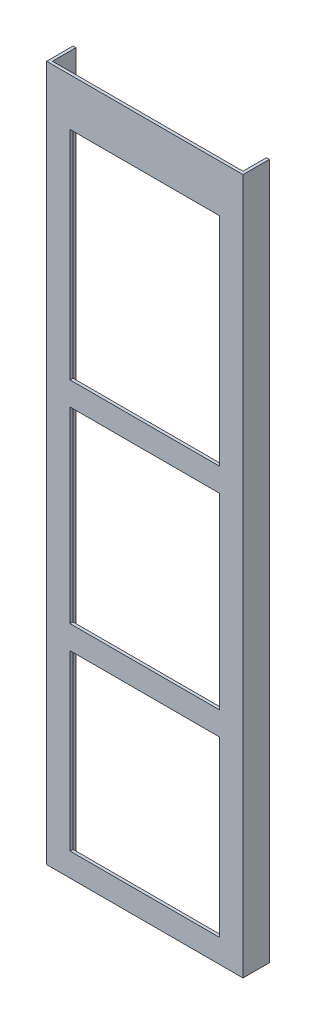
ISO-10303-21;
HEADER;
FILE_DESCRIPTION(('STEP AP214'),'2;1');
FILE_NAME('part.step','',(''),(''),'','','');
FILE_SCHEMA(('AUTOMOTIVE_DESIGN { 1 0 10303 214 1 1 1 1 }'));
ENDSEC;
DATA;
#1=APPLICATION_CONTEXT('core data for automotive mechanical design processes');
#2=APPLICATION_PROTOCOL_DEFINITION('international standard','automotive_design',2000,#1);
#3=PRODUCT_CONTEXT('',#1,'mechanical');
#4=PRODUCT('Part','Part','',(#3));
#5=PRODUCT_RELATED_PRODUCT_CATEGORY('part','',(#4));
#6=PRODUCT_DEFINITION_FORMATION('','',#4);
#7=PRODUCT_DEFINITION_CONTEXT('part definition',#1,'design');
#8=PRODUCT_DEFINITION('design','',#6,#7);
#9=PRODUCT_DEFINITION_SHAPE('','',#8);
#10=(LENGTH_UNIT() NAMED_UNIT(*) SI_UNIT(.MILLI.,.METRE.));
#11=(NAMED_UNIT(*) PLANE_ANGLE_UNIT() SI_UNIT($,.RADIAN.));
#12=(NAMED_UNIT(*) SI_UNIT($,.STERADIAN.) SOLID_ANGLE_UNIT());
#13=UNCERTAINTY_MEASURE_WITH_UNIT(LENGTH_MEASURE(1.E-05),#10,'distance_accuracy_value','');
#14=(GEOMETRIC_REPRESENTATION_CONTEXT(3) GLOBAL_UNCERTAINTY_ASSIGNED_CONTEXT((#13)) GLOBAL_UNIT_ASSIGNED_CONTEXT((#10,
#11,#12)) REPRESENTATION_CONTEXT('',''));
#15=CARTESIAN_POINT('',(0.,0.,0.));
#16=DIRECTION('',(0.,0.,1.));
#17=DIRECTION('',(1.,0.,0.));
#18=AXIS2_PLACEMENT_3D('',#15,#16,#17);
#19=CARTESIAN_POINT('',(-40.475,12.7,49.0475));
#20=DIRECTION('',(-1.,0.,0.));
#21=DIRECTION('',(0.,0.,1.));
#22=AXIS2_PLACEMENT_3D('',#19,#20,#21);
#23=PLANE('',#22);
#24=DIRECTION('',(0.,0.,1.));
#25=VECTOR('',#24,1.);
#26=CARTESIAN_POINT('',(-40.475,119.38,50.));
#27=LINE('',#26,#25);
#28=CARTESIAN_POINT('',(-40.475,119.38,50.));
#29=VERTEX_POINT('',#28);
#30=CARTESIAN_POINT('',(-40.475,119.38,51.5875));
#31=VERTEX_POINT('',#30);
#32=EDGE_CURVE('E59',#29,#31,#27,.T.);
#33=ORIENTED_EDGE('',*,*,#32,.F.);
#34=DIRECTION('',(0.,1.,0.));
#35=VECTOR('',#34,1.);
#36=CARTESIAN_POINT('',(-40.475,376.8,50.));
#37=LINE('',#36,#35);
#38=CARTESIAN_POINT('',(-40.475,220.98,50.));
#39=VERTEX_POINT('',#38);
#40=EDGE_CURVE('E267',#29,#39,#37,.T.);
#41=ORIENTED_EDGE('',*,*,#40,.T.);
#42=DIRECTION('',(0.,0.,1.));
#43=VECTOR('',#42,1.);
#44=CARTESIAN_POINT('',(-40.475,220.98,50.));
#45=LINE('',#44,#43);
#46=CARTESIAN_POINT('',(-40.475,220.98,51.5875));
#47=VERTEX_POINT('',#46);
#48=EDGE_CURVE('E236',#39,#47,#45,.T.);
#49=ORIENTED_EDGE('',*,*,#48,.T.);
#50=DIRECTION('',(0.,-1.,0.));
#51=VECTOR('',#50,1.);
#52=CARTESIAN_POINT('',(-40.475,12.7,51.5875));
#53=LINE('',#52,#51);
#54=EDGE_CURVE('E55',#47,#31,#53,.T.);
#55=ORIENTED_EDGE('',*,*,#54,.T.);
#56=EDGE_LOOP('',(#33,#41,#49,#55));
#57=FACE_BOUND('',#56,.T.);
#58=ADVANCED_FACE('F39',(#57),#23,.F.);
#59=CARTESIAN_POINT('',(40.475,12.7,49.0475));
#60=DIRECTION('',(1.,0.,0.));
#61=DIRECTION('',(0.,0.,-1.));
#62=AXIS2_PLACEMENT_3D('',#59,#60,#61);
#63=PLANE('',#62);
#64=DIRECTION('',(0.,0.,1.));
#65=VECTOR('',#64,1.);
#66=CARTESIAN_POINT('',(40.475,119.38,50.));
#67=LINE('',#66,#65);
#68=CARTESIAN_POINT('',(40.475,119.38,50.));
#69=VERTEX_POINT('',#68);
#70=CARTESIAN_POINT('',(40.475,119.38,51.5875));
#71=VERTEX_POINT('',#70);
#72=EDGE_CURVE('E211',#69,#71,#67,.T.);
#73=ORIENTED_EDGE('',*,*,#72,.T.);
#74=DIRECTION('',(0.,1.,0.));
#75=VECTOR('',#74,1.);
#76=CARTESIAN_POINT('',(40.475,12.7,51.5875));
#77=LINE('',#76,#75);
#78=CARTESIAN_POINT('',(40.475,220.98,51.5875));
#79=VERTEX_POINT('',#78);
#80=EDGE_CURVE('E254',#71,#79,#77,.T.);
#81=ORIENTED_EDGE('',*,*,#80,.T.);
#82=DIRECTION('',(0.,0.,1.));
#83=VECTOR('',#82,1.);
#84=CARTESIAN_POINT('',(40.475,220.98,50.));
#85=LINE('',#84,#83);
#86=CARTESIAN_POINT('',(40.475,220.98,50.));
#87=VERTEX_POINT('',#86);
#88=EDGE_CURVE('E233',#87,#79,#85,.T.);
#89=ORIENTED_EDGE('',*,*,#88,.F.);
#90=DIRECTION('',(0.,-1.,0.));
#91=VECTOR('',#90,1.);
#92=CARTESIAN_POINT('',(40.475,376.8,50.));
#93=LINE('',#92,#91);
#94=EDGE_CURVE('E264',#87,#69,#93,.T.);
#95=ORIENTED_EDGE('',*,*,#94,.T.);
#96=EDGE_LOOP('',(#73,#81,#89,#95));
#97=FACE_BOUND('',#96,.T.);
#98=ADVANCED_FACE('F379',(#97),#63,.F.);
#99=DIRECTION('',(0.,0.,1.));
#100=VECTOR('',#99,1.);
#101=CARTESIAN_POINT('',(-40.475,233.68,50.));
#102=LINE('',#101,#100);
#103=CARTESIAN_POINT('',(-40.475,233.68,50.));
#104=VERTEX_POINT('',#103);
#105=CARTESIAN_POINT('',(-40.475,233.68,51.5875));
#106=VERTEX_POINT('',#105);
#107=EDGE_CURVE('E224',#104,#106,#102,.T.);
#108=ORIENTED_EDGE('',*,*,#107,.F.);
#109=CARTESIAN_POINT('',(-40.475,351.155,50.));
#110=VERTEX_POINT('',#109);
#111=EDGE_CURVE('E263',#104,#110,#37,.T.);
#112=ORIENTED_EDGE('',*,*,#111,.T.);
#113=DIRECTION('',(0.,0.,1.));
#114=VECTOR('',#113,1.);
#115=CARTESIAN_POINT('',(-40.475,351.155,50.));
#116=LINE('',#115,#114);
#117=CARTESIAN_POINT('',(-40.475,351.155,51.5875));
#118=VERTEX_POINT('',#117);
#119=EDGE_CURVE('E243',#110,#118,#116,.T.);
#120=ORIENTED_EDGE('',*,*,#119,.T.);
#121=EDGE_CURVE('E188',#118,#106,#53,.T.);
#122=ORIENTED_EDGE('',*,*,#121,.T.);
#123=EDGE_LOOP('',(#108,#112,#120,#122));
#124=FACE_BOUND('',#123,.T.);
#125=ADVANCED_FACE('F381',(#124),#23,.F.);
#126=DIRECTION('',(0.,0.,1.));
#127=VECTOR('',#126,1.);
#128=CARTESIAN_POINT('',(40.475,233.68,50.));
#129=LINE('',#128,#127);
#130=CARTESIAN_POINT('',(40.475,233.68,50.));
#131=VERTEX_POINT('',#130);
#132=CARTESIAN_POINT('',(40.475,233.68,51.5875));
#133=VERTEX_POINT('',#132);
#134=EDGE_CURVE('E229',#131,#133,#129,.T.);
#135=ORIENTED_EDGE('',*,*,#134,.T.);
#136=CARTESIAN_POINT('',(40.475,351.155,51.5875));
#137=VERTEX_POINT('',#136);
#138=EDGE_CURVE('E250',#133,#137,#77,.T.);
#139=ORIENTED_EDGE('',*,*,#138,.T.);
#140=DIRECTION('',(0.,0.,1.));
#141=VECTOR('',#140,1.);
#142=CARTESIAN_POINT('',(40.475,351.155,50.));
#143=LINE('',#142,#141);
#144=CARTESIAN_POINT('',(40.475,351.155,50.));
#145=VERTEX_POINT('',#144);
#146=EDGE_CURVE('E186',#145,#137,#143,.T.);
#147=ORIENTED_EDGE('',*,*,#146,.F.);
#148=EDGE_CURVE('E261',#145,#131,#93,.T.);
#149=ORIENTED_EDGE('',*,*,#148,.T.);
#150=EDGE_LOOP('',(#135,#139,#147,#149));
#151=FACE_BOUND('',#150,.T.);
#152=ADVANCED_FACE('F388',(#151),#63,.F.);
#153=CARTESIAN_POINT('',(50.,376.8,50.));
#154=DIRECTION('',(0.,0.,-1.));
#155=DIRECTION('',(-1.,0.,0.));
#156=AXIS2_PLACEMENT_3D('',#153,#154,#155);
#157=PLANE('',#156);
#158=ORIENTED_EDGE('',*,*,#40,.F.);
#159=DIRECTION('',(1.,0.,0.));
#160=VECTOR('',#159,1.);
#161=CARTESIAN_POINT('',(0.,119.38,50.));
#162=LINE('',#161,#160);
#163=EDGE_CURVE('E201',#29,#69,#162,.T.);
#164=ORIENTED_EDGE('',*,*,#163,.T.);
#165=ORIENTED_EDGE('',*,*,#94,.F.);
#166=DIRECTION('',(1.,0.,0.));
#167=VECTOR('',#166,1.);
#168=CARTESIAN_POINT('',(0.,220.98,50.));
#169=LINE('',#168,#167);
#170=EDGE_CURVE('E220',#39,#87,#169,.T.);
#171=ORIENTED_EDGE('',*,*,#170,.F.);
#172=EDGE_LOOP('',(#158,#164,#165,#171));
#173=FACE_BOUND('',#172,.T.);
#174=ORIENTED_EDGE('',*,*,#111,.F.);
#175=DIRECTION('',(1.,0.,0.));
#176=VECTOR('',#175,1.);
#177=CARTESIAN_POINT('',(0.,233.68,50.));
#178=LINE('',#177,#176);
#179=EDGE_CURVE('E217',#104,#131,#178,.T.);
#180=ORIENTED_EDGE('',*,*,#179,.T.);
#181=ORIENTED_EDGE('',*,*,#148,.F.);
#182=DIRECTION('',(1.,0.,0.));
#183=VECTOR('',#182,1.);
#184=CARTESIAN_POINT('',(0.,351.155,50.));
#185=LINE('',#184,#183);
#186=EDGE_CURVE('E240',#110,#145,#185,.T.);
#187=ORIENTED_EDGE('',*,*,#186,.F.);
#188=EDGE_LOOP('',(#174,#180,#181,#187));
#189=FACE_BOUND('',#188,.T.);
#190=CARTESIAN_POINT('',(-40.475,12.7,50.));
#191=VERTEX_POINT('',#190);
#192=CARTESIAN_POINT('',(-40.475,106.68,50.));
#193=VERTEX_POINT('',#192);
#194=EDGE_CURVE('E193',#191,#193,#37,.T.);
#195=ORIENTED_EDGE('',*,*,#194,.F.);
#196=DIRECTION('',(-1.,0.,0.));
#197=VECTOR('',#196,1.);
#198=CARTESIAN_POINT('',(50.,12.7,50.));
#199=LINE('',#198,#197);
#200=CARTESIAN_POINT('',(40.475,12.7,50.));
#201=VERTEX_POINT('',#200);
#202=EDGE_CURVE('E257',#201,#191,#199,.T.);
#203=ORIENTED_EDGE('',*,*,#202,.F.);
#204=CARTESIAN_POINT('',(40.475,106.68,50.));
#205=VERTEX_POINT('',#204);
#206=EDGE_CURVE('E260',#205,#201,#93,.T.);
#207=ORIENTED_EDGE('',*,*,#206,.F.);
#208=DIRECTION('',(1.,0.,0.));
#209=VECTOR('',#208,1.);
#210=CARTESIAN_POINT('',(0.,106.68,50.));
#211=LINE('',#210,#209);
#212=EDGE_CURVE('E205',#193,#205,#211,.T.);
#213=ORIENTED_EDGE('',*,*,#212,.F.);
#214=EDGE_LOOP('',(#195,#203,#207,#213));
#215=FACE_BOUND('',#214,.T.);
#216=DIRECTION('',(1.,0.,0.));
#217=VECTOR('',#216,1.);
#218=CARTESIAN_POINT('',(-51.6,0.,50.));
#219=LINE('',#218,#217);
#220=CARTESIAN_POINT('',(-51.5875000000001,0.,50.));
#221=VERTEX_POINT('',#220);
#222=CARTESIAN_POINT('',(51.5875,0.,50.));
#223=VERTEX_POINT('',#222);
#224=EDGE_CURVE('E315',#221,#223,#219,.T.);
#225=ORIENTED_EDGE('',*,*,#224,.F.);
#226=DIRECTION('',(0.,-1.,0.));
#227=VECTOR('',#226,1.);
#228=CARTESIAN_POINT('',(-51.5875,376.8,50.));
#229=LINE('',#228,#227);
#230=CARTESIAN_POINT('',(-51.5875,376.8,50.));
#231=VERTEX_POINT('',#230);
#232=EDGE_CURVE('E266',#231,#221,#229,.T.);
#233=ORIENTED_EDGE('',*,*,#232,.F.);
#234=DIRECTION('',(1.,0.,0.));
#235=VECTOR('',#234,1.);
#236=CARTESIAN_POINT('',(50.,376.8,50.));
#237=LINE('',#236,#235);
#238=CARTESIAN_POINT('',(51.5875,376.8,50.));
#239=VERTEX_POINT('',#238);
#240=EDGE_CURVE('E11',#231,#239,#237,.T.);
#241=ORIENTED_EDGE('',*,*,#240,.T.);
#242=DIRECTION('',(0.,1.,0.));
#243=VECTOR('',#242,1.);
#244=CARTESIAN_POINT('',(51.5875,376.8,50.));
#245=LINE('',#244,#243);
#246=EDGE_CURVE('E286',#223,#239,#245,.T.);
#247=ORIENTED_EDGE('',*,*,#246,.F.);
#248=EDGE_LOOP('',(#225,#233,#241,#247));
#249=FACE_BOUND('',#248,.T.);
#250=ADVANCED_FACE('F356',(#173,#189,#215,#249),#157,.T.);
#251=CARTESIAN_POINT('',(0.,376.8,0.));
#252=DIRECTION('',(0.,-1.,0.));
#253=DIRECTION('',(0.,0.,-1.));
#254=AXIS2_PLACEMENT_3D('',#251,#252,#253);
#255=PLANE('',#254);
#256=DIRECTION('',(1.,0.,0.));
#257=VECTOR('',#256,1.);
#258=CARTESIAN_POINT('',(51.5875,376.8,51.5875));
#259=LINE('',#258,#257);
#260=CARTESIAN_POINT('',(-53.175,376.8,51.5875));
#261=VERTEX_POINT('',#260);
#262=CARTESIAN_POINT('',(53.175,376.8,51.5875));
#263=VERTEX_POINT('',#262);
#264=EDGE_CURVE('E316',#261,#263,#259,.T.);
#265=ORIENTED_EDGE('',*,*,#264,.T.);
#266=DIRECTION('',(0.,0.,1.));
#267=VECTOR('',#266,1.);
#268=CARTESIAN_POINT('',(53.175,376.8,51.5875));
#269=LINE('',#268,#267);
#270=CARTESIAN_POINT('',(53.175,376.8,37.3));
#271=VERTEX_POINT('',#270);
#272=EDGE_CURVE('E321',#271,#263,#269,.T.);
#273=ORIENTED_EDGE('',*,*,#272,.F.);
#274=DIRECTION('',(1.,0.,0.));
#275=VECTOR('',#274,1.);
#276=CARTESIAN_POINT('',(53.175,376.8,37.3));
#277=LINE('',#276,#275);
#278=CARTESIAN_POINT('',(51.5875,376.8,37.3));
#279=VERTEX_POINT('',#278);
#280=EDGE_CURVE('E294',#279,#271,#277,.T.);
#281=ORIENTED_EDGE('',*,*,#280,.F.);
#282=DIRECTION('',(0.,0.,1.));
#283=VECTOR('',#282,1.);
#284=CARTESIAN_POINT('',(51.5875,376.8,37.3));
#285=LINE('',#284,#283);
#286=EDGE_CURVE('E297',#279,#239,#285,.T.);
#287=ORIENTED_EDGE('',*,*,#286,.T.);
#288=ORIENTED_EDGE('',*,*,#240,.F.);
#289=DIRECTION('',(0.,0.,1.));
#290=VECTOR('',#289,1.);
#291=CARTESIAN_POINT('',(-51.5875,376.8,37.3));
#292=LINE('',#291,#290);
#293=CARTESIAN_POINT('',(-51.5875,376.8,37.3));
#294=VERTEX_POINT('',#293);
#295=EDGE_CURVE('E283',#294,#231,#292,.T.);
#296=ORIENTED_EDGE('',*,*,#295,.F.);
#297=DIRECTION('',(1.,0.,0.));
#298=VECTOR('',#297,1.);
#299=CARTESIAN_POINT('',(-53.175,376.8,37.3));
#300=LINE('',#299,#298);
#301=CARTESIAN_POINT('',(-53.175,376.8,37.3));
#302=VERTEX_POINT('',#301);
#303=EDGE_CURVE('E271',#302,#294,#300,.T.);
#304=ORIENTED_EDGE('',*,*,#303,.F.);
#305=DIRECTION('',(0.,0.,1.));
#306=VECTOR('',#305,1.);
#307=CARTESIAN_POINT('',(-53.175,376.8,51.5875));
#308=LINE('',#307,#306);
#309=EDGE_CURVE('E335',#302,#261,#308,.T.);
#310=ORIENTED_EDGE('',*,*,#309,.T.);
#311=EDGE_LOOP('',(#265,#273,#281,#287,#288,#296,#304,#310));
#312=FACE_BOUND('',#311,.T.);
#313=ADVANCED_FACE('F41',(#312),#255,.F.);
#314=CARTESIAN_POINT('',(0.,0.,0.));
#315=DIRECTION('',(0.,-1.,0.));
#316=DIRECTION('',(0.,0.,-1.));
#317=AXIS2_PLACEMENT_3D('',#314,#315,#316);
#318=PLANE('',#317);
#319=DIRECTION('',(0.,0.,-1.));
#320=VECTOR('',#319,1.);
#321=CARTESIAN_POINT('',(-53.175,0.,51.5875));
#322=LINE('',#321,#320);
#323=CARTESIAN_POINT('',(-53.175,0.,51.5875));
#324=VERTEX_POINT('',#323);
#325=CARTESIAN_POINT('',(-53.175,0.,37.3));
#326=VERTEX_POINT('',#325);
#327=EDGE_CURVE('E334',#324,#326,#322,.T.);
#328=ORIENTED_EDGE('',*,*,#327,.T.);
#329=DIRECTION('',(-1.,0.,0.));
#330=VECTOR('',#329,1.);
#331=CARTESIAN_POINT('',(-53.175,0.,37.3));
#332=LINE('',#331,#330);
#333=CARTESIAN_POINT('',(-51.5875000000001,0.,37.3));
#334=VERTEX_POINT('',#333);
#335=EDGE_CURVE('E275',#334,#326,#332,.T.);
#336=ORIENTED_EDGE('',*,*,#335,.F.);
#337=DIRECTION('',(0.,0.,1.));
#338=VECTOR('',#337,1.);
#339=CARTESIAN_POINT('',(-51.5875000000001,0.,37.3));
#340=LINE('',#339,#338);
#341=EDGE_CURVE('E278',#334,#221,#340,.T.);
#342=ORIENTED_EDGE('',*,*,#341,.T.);
#343=ORIENTED_EDGE('',*,*,#224,.T.);
#344=DIRECTION('',(0.,0.,1.));
#345=VECTOR('',#344,1.);
#346=CARTESIAN_POINT('',(51.5875,0.,37.3));
#347=LINE('',#346,#345);
#348=CARTESIAN_POINT('',(51.5875,0.,37.3));
#349=VERTEX_POINT('',#348);
#350=EDGE_CURVE('E309',#349,#223,#347,.T.);
#351=ORIENTED_EDGE('',*,*,#350,.F.);
#352=DIRECTION('',(-1.,0.,0.));
#353=VECTOR('',#352,1.);
#354=CARTESIAN_POINT('',(53.175,0.,37.3));
#355=LINE('',#354,#353);
#356=CARTESIAN_POINT('',(53.175,0.,37.3));
#357=VERTEX_POINT('',#356);
#358=EDGE_CURVE('E290',#357,#349,#355,.T.);
#359=ORIENTED_EDGE('',*,*,#358,.F.);
#360=DIRECTION('',(0.,0.,-1.));
#361=VECTOR('',#360,1.);
#362=CARTESIAN_POINT('',(53.175,0.,51.5875));
#363=LINE('',#362,#361);
#364=CARTESIAN_POINT('',(53.175,0.,51.5875));
#365=VERTEX_POINT('',#364);
#366=EDGE_CURVE('E326',#365,#357,#363,.T.);
#367=ORIENTED_EDGE('',*,*,#366,.F.);
#368=DIRECTION('',(1.,0.,0.));
#369=VECTOR('',#368,1.);
#370=CARTESIAN_POINT('',(51.5875,0.,51.5875));
#371=LINE('',#370,#369);
#372=EDGE_CURVE('E48',#324,#365,#371,.T.);
#373=ORIENTED_EDGE('',*,*,#372,.F.);
#374=EDGE_LOOP('',(#328,#336,#342,#343,#351,#359,#367,#373));
#375=FACE_BOUND('',#374,.T.);
#376=ADVANCED_FACE('F346',(#375),#318,.T.);
#377=CARTESIAN_POINT('',(51.5875,376.8,51.5875));
#378=DIRECTION('',(0.,0.,-1.));
#379=DIRECTION('',(-1.,0.,0.));
#380=AXIS2_PLACEMENT_3D('',#377,#378,#379);
#381=PLANE('',#380);
#382=DIRECTION('',(1.,0.,0.));
#383=VECTOR('',#382,1.);
#384=CARTESIAN_POINT('',(0.,119.38,51.5875));
#385=LINE('',#384,#383);
#386=EDGE_CURVE('E202',#31,#71,#385,.T.);
#387=ORIENTED_EDGE('',*,*,#386,.F.);
#388=ORIENTED_EDGE('',*,*,#54,.F.);
#389=DIRECTION('',(1.,0.,0.));
#390=VECTOR('',#389,1.);
#391=CARTESIAN_POINT('',(0.,220.98,51.5875));
#392=LINE('',#391,#390);
#393=EDGE_CURVE('E221',#47,#79,#392,.T.);
#394=ORIENTED_EDGE('',*,*,#393,.T.);
#395=ORIENTED_EDGE('',*,*,#80,.F.);
#396=EDGE_LOOP('',(#387,#388,#394,#395));
#397=FACE_BOUND('',#396,.T.);
#398=DIRECTION('',(1.,0.,0.));
#399=VECTOR('',#398,1.);
#400=CARTESIAN_POINT('',(0.,233.68,51.5875));
#401=LINE('',#400,#399);
#402=EDGE_CURVE('E214',#106,#133,#401,.T.);
#403=ORIENTED_EDGE('',*,*,#402,.F.);
#404=ORIENTED_EDGE('',*,*,#121,.F.);
#405=DIRECTION('',(1.,0.,0.));
#406=VECTOR('',#405,1.);
#407=CARTESIAN_POINT('',(0.,351.155,51.5875));
#408=LINE('',#407,#406);
#409=EDGE_CURVE('E232',#118,#137,#408,.T.);
#410=ORIENTED_EDGE('',*,*,#409,.T.);
#411=ORIENTED_EDGE('',*,*,#138,.F.);
#412=EDGE_LOOP('',(#403,#404,#410,#411));
#413=FACE_BOUND('',#412,.T.);
#414=CARTESIAN_POINT('',(-40.475,106.68,51.5875));
#415=VERTEX_POINT('',#414);
#416=CARTESIAN_POINT('',(-40.475,12.7,51.5875));
#417=VERTEX_POINT('',#416);
#418=EDGE_CURVE('E174',#415,#417,#53,.T.);
#419=ORIENTED_EDGE('',*,*,#418,.F.);
#420=DIRECTION('',(1.,0.,0.));
#421=VECTOR('',#420,1.);
#422=CARTESIAN_POINT('',(0.,106.68,51.5875));
#423=LINE('',#422,#421);
#424=CARTESIAN_POINT('',(40.475,106.68,51.5875));
#425=VERTEX_POINT('',#424);
#426=EDGE_CURVE('E180',#415,#425,#423,.T.);
#427=ORIENTED_EDGE('',*,*,#426,.T.);
#428=CARTESIAN_POINT('',(40.475,12.7,51.5875));
#429=VERTEX_POINT('',#428);
#430=EDGE_CURVE('E251',#429,#425,#77,.T.);
#431=ORIENTED_EDGE('',*,*,#430,.F.);
#432=DIRECTION('',(1.,0.,0.));
#433=VECTOR('',#432,1.);
#434=CARTESIAN_POINT('',(40.475,12.7,51.5875));
#435=LINE('',#434,#433);
#436=EDGE_CURVE('E182',#417,#429,#435,.T.);
#437=ORIENTED_EDGE('',*,*,#436,.F.);
#438=EDGE_LOOP('',(#419,#427,#431,#437));
#439=FACE_BOUND('',#438,.T.);
#440=ORIENTED_EDGE('',*,*,#372,.T.);
#441=DIRECTION('',(0.,-1.,0.));
#442=VECTOR('',#441,1.);
#443=CARTESIAN_POINT('',(53.175,376.8,51.5875));
#444=LINE('',#443,#442);
#445=EDGE_CURVE('E331',#263,#365,#444,.T.);
#446=ORIENTED_EDGE('',*,*,#445,.F.);
#447=ORIENTED_EDGE('',*,*,#264,.F.);
#448=DIRECTION('',(0.,-1.,0.));
#449=VECTOR('',#448,1.);
#450=CARTESIAN_POINT('',(-53.175,376.8,51.5875));
#451=LINE('',#450,#449);
#452=EDGE_CURVE('E300',#261,#324,#451,.T.);
#453=ORIENTED_EDGE('',*,*,#452,.T.);
#454=EDGE_LOOP('',(#440,#446,#447,#453));
#455=FACE_BOUND('',#454,.T.);
#456=ADVANCED_FACE('F176',(#397,#413,#439,#455),#381,.F.);
#457=CARTESIAN_POINT('',(53.175,0.,0.));
#458=DIRECTION('',(1.,0.,0.));
#459=DIRECTION('',(0.,0.,-1.));
#460=AXIS2_PLACEMENT_3D('',#457,#458,#459);
#461=PLANE('',#460);
#462=ORIENTED_EDGE('',*,*,#445,.T.);
#463=ORIENTED_EDGE('',*,*,#366,.T.);
#464=DIRECTION('',(0.,-1.,0.));
#465=VECTOR('',#464,1.);
#466=CARTESIAN_POINT('',(53.175,376.8,37.3));
#467=LINE('',#466,#465);
#468=EDGE_CURVE('E287',#271,#357,#467,.T.);
#469=ORIENTED_EDGE('',*,*,#468,.F.);
#470=ORIENTED_EDGE('',*,*,#272,.T.);
#471=EDGE_LOOP('',(#462,#463,#469,#470));
#472=FACE_BOUND('',#471,.T.);
#473=ADVANCED_FACE('F367',(#472),#461,.T.);
#474=CARTESIAN_POINT('',(-53.175,0.,0.));
#475=DIRECTION('',(-1.,0.,0.));
#476=DIRECTION('',(0.,0.,-1.));
#477=AXIS2_PLACEMENT_3D('',#474,#475,#476);
#478=PLANE('',#477);
#479=ORIENTED_EDGE('',*,*,#452,.F.);
#480=ORIENTED_EDGE('',*,*,#309,.F.);
#481=DIRECTION('',(0.,1.,0.));
#482=VECTOR('',#481,1.);
#483=CARTESIAN_POINT('',(-53.175,376.8,37.3));
#484=LINE('',#483,#482);
#485=EDGE_CURVE('E268',#326,#302,#484,.T.);
#486=ORIENTED_EDGE('',*,*,#485,.F.);
#487=ORIENTED_EDGE('',*,*,#327,.F.);
#488=EDGE_LOOP('',(#479,#480,#486,#487));
#489=FACE_BOUND('',#488,.T.);
#490=ADVANCED_FACE('F344',(#489),#478,.T.);
#491=CARTESIAN_POINT('',(51.5875,376.8,37.3));
#492=DIRECTION('',(1.,0.,0.));
#493=DIRECTION('',(0.,1.,0.));
#494=AXIS2_PLACEMENT_3D('',#491,#492,#493);
#495=PLANE('',#494);
#496=ORIENTED_EDGE('',*,*,#246,.T.);
#497=ORIENTED_EDGE('',*,*,#286,.F.);
#498=DIRECTION('',(0.,1.,0.));
#499=VECTOR('',#498,1.);
#500=CARTESIAN_POINT('',(51.5875,376.8,37.3));
#501=LINE('',#500,#499);
#502=EDGE_CURVE('E292',#349,#279,#501,.T.);
#503=ORIENTED_EDGE('',*,*,#502,.F.);
#504=ORIENTED_EDGE('',*,*,#350,.T.);
#505=EDGE_LOOP('',(#496,#497,#503,#504));
#506=FACE_BOUND('',#505,.T.);
#507=ADVANCED_FACE('F361',(#506),#495,.F.);
#508=CARTESIAN_POINT('',(0.,0.,37.3));
#509=DIRECTION('',(0.,0.,-1.));
#510=DIRECTION('',(-1.,0.,0.));
#511=AXIS2_PLACEMENT_3D('',#508,#509,#510);
#512=PLANE('',#511);
#513=ORIENTED_EDGE('',*,*,#468,.T.);
#514=ORIENTED_EDGE('',*,*,#358,.T.);
#515=ORIENTED_EDGE('',*,*,#502,.T.);
#516=ORIENTED_EDGE('',*,*,#280,.T.);
#517=EDGE_LOOP('',(#513,#514,#515,#516));
#518=FACE_BOUND('',#517,.T.);
#519=ADVANCED_FACE('F365',(#518),#512,.T.);
#520=CARTESIAN_POINT('',(-51.5875,376.8,37.3));
#521=DIRECTION('',(-1.,0.,0.));
#522=DIRECTION('',(0.,-1.,0.));
#523=AXIS2_PLACEMENT_3D('',#520,#521,#522);
#524=PLANE('',#523);
#525=ORIENTED_EDGE('',*,*,#232,.T.);
#526=ORIENTED_EDGE('',*,*,#341,.F.);
#527=DIRECTION('',(0.,-1.,0.));
#528=VECTOR('',#527,1.);
#529=CARTESIAN_POINT('',(-51.5875,376.8,37.3));
#530=LINE('',#529,#528);
#531=EDGE_CURVE('E273',#294,#334,#530,.T.);
#532=ORIENTED_EDGE('',*,*,#531,.F.);
#533=ORIENTED_EDGE('',*,*,#295,.T.);
#534=EDGE_LOOP('',(#525,#526,#532,#533));
#535=FACE_BOUND('',#534,.T.);
#536=ADVANCED_FACE('F353',(#535),#524,.F.);
#537=CARTESIAN_POINT('',(0.,0.,37.3));
#538=DIRECTION('',(0.,0.,1.));
#539=DIRECTION('',(1.,0.,0.));
#540=AXIS2_PLACEMENT_3D('',#537,#538,#539);
#541=PLANE('',#540);
#542=ORIENTED_EDGE('',*,*,#485,.T.);
#543=ORIENTED_EDGE('',*,*,#303,.T.);
#544=ORIENTED_EDGE('',*,*,#531,.T.);
#545=ORIENTED_EDGE('',*,*,#335,.T.);
#546=EDGE_LOOP('',(#542,#543,#544,#545));
#547=FACE_BOUND('',#546,.T.);
#548=ADVANCED_FACE('F348',(#547),#541,.F.);
#549=ORIENTED_EDGE('',*,*,#194,.T.);
#550=DIRECTION('',(0.,0.,1.));
#551=VECTOR('',#550,1.);
#552=CARTESIAN_POINT('',(-40.475,106.68,50.));
#553=LINE('',#552,#551);
#554=EDGE_CURVE('E190',#193,#415,#553,.T.);
#555=ORIENTED_EDGE('',*,*,#554,.T.);
#556=ORIENTED_EDGE('',*,*,#418,.T.);
#557=DIRECTION('',(0.,0.,1.));
#558=VECTOR('',#557,1.);
#559=CARTESIAN_POINT('',(-40.475,12.7,49.0475));
#560=LINE('',#559,#558);
#561=EDGE_CURVE('E253',#191,#417,#560,.T.);
#562=ORIENTED_EDGE('',*,*,#561,.F.);
#563=EDGE_LOOP('',(#549,#555,#556,#562));
#564=FACE_BOUND('',#563,.T.);
#565=ADVANCED_FACE('F191',(#564),#23,.F.);
#566=ORIENTED_EDGE('',*,*,#430,.T.);
#567=DIRECTION('',(0.,0.,1.));
#568=VECTOR('',#567,1.);
#569=CARTESIAN_POINT('',(40.475,106.68,50.));
#570=LINE('',#569,#568);
#571=EDGE_CURVE('E197',#205,#425,#570,.T.);
#572=ORIENTED_EDGE('',*,*,#571,.F.);
#573=ORIENTED_EDGE('',*,*,#206,.T.);
#574=DIRECTION('',(0.,0.,1.));
#575=VECTOR('',#574,1.);
#576=CARTESIAN_POINT('',(40.475,12.7,49.0475));
#577=LINE('',#576,#575);
#578=EDGE_CURVE('E255',#201,#429,#577,.T.);
#579=ORIENTED_EDGE('',*,*,#578,.T.);
#580=EDGE_LOOP('',(#566,#572,#573,#579));
#581=FACE_BOUND('',#580,.T.);
#582=ADVANCED_FACE('F389',(#581),#63,.F.);
#583=CARTESIAN_POINT('',(40.475,12.7,49.0475));
#584=DIRECTION('',(0.,-1.,0.));
#585=DIRECTION('',(0.,0.,-1.));
#586=AXIS2_PLACEMENT_3D('',#583,#584,#585);
#587=PLANE('',#586);
#588=ORIENTED_EDGE('',*,*,#202,.T.);
#589=ORIENTED_EDGE('',*,*,#561,.T.);
#590=ORIENTED_EDGE('',*,*,#436,.T.);
#591=ORIENTED_EDGE('',*,*,#578,.F.);
#592=EDGE_LOOP('',(#588,#589,#590,#591));
#593=FACE_BOUND('',#592,.T.);
#594=ADVANCED_FACE('F399',(#593),#587,.F.);
#595=CARTESIAN_POINT('',(0.,351.155,50.));
#596=DIRECTION('',(0.,-1.,0.));
#597=DIRECTION('',(0.,0.,-1.));
#598=AXIS2_PLACEMENT_3D('',#595,#596,#597);
#599=PLANE('',#598);
#600=ORIENTED_EDGE('',*,*,#409,.F.);
#601=ORIENTED_EDGE('',*,*,#119,.F.);
#602=ORIENTED_EDGE('',*,*,#186,.T.);
#603=ORIENTED_EDGE('',*,*,#146,.T.);
#604=EDGE_LOOP('',(#600,#601,#602,#603));
#605=FACE_BOUND('',#604,.T.);
#606=ADVANCED_FACE('F434',(#605),#599,.T.);
#607=CARTESIAN_POINT('',(0.,233.68,50.));
#608=DIRECTION('',(0.,-1.,0.));
#609=DIRECTION('',(0.,0.,-1.));
#610=AXIS2_PLACEMENT_3D('',#607,#608,#609);
#611=PLANE('',#610);
#612=ORIENTED_EDGE('',*,*,#402,.T.);
#613=ORIENTED_EDGE('',*,*,#134,.F.);
#614=ORIENTED_EDGE('',*,*,#179,.F.);
#615=ORIENTED_EDGE('',*,*,#107,.T.);
#616=EDGE_LOOP('',(#612,#613,#614,#615));
#617=FACE_BOUND('',#616,.T.);
#618=ADVANCED_FACE('F481',(#617),#611,.F.);
#619=CARTESIAN_POINT('',(0.,220.98,50.));
#620=DIRECTION('',(0.,-1.,0.));
#621=DIRECTION('',(0.,0.,-1.));
#622=AXIS2_PLACEMENT_3D('',#619,#620,#621);
#623=PLANE('',#622);
#624=ORIENTED_EDGE('',*,*,#393,.F.);
#625=ORIENTED_EDGE('',*,*,#48,.F.);
#626=ORIENTED_EDGE('',*,*,#170,.T.);
#627=ORIENTED_EDGE('',*,*,#88,.T.);
#628=EDGE_LOOP('',(#624,#625,#626,#627));
#629=FACE_BOUND('',#628,.T.);
#630=ADVANCED_FACE('F489',(#629),#623,.T.);
#631=CARTESIAN_POINT('',(0.,119.38,50.));
#632=DIRECTION('',(0.,-1.,0.));
#633=DIRECTION('',(0.,0.,-1.));
#634=AXIS2_PLACEMENT_3D('',#631,#632,#633);
#635=PLANE('',#634);
#636=ORIENTED_EDGE('',*,*,#386,.T.);
#637=ORIENTED_EDGE('',*,*,#72,.F.);
#638=ORIENTED_EDGE('',*,*,#163,.F.);
#639=ORIENTED_EDGE('',*,*,#32,.T.);
#640=EDGE_LOOP('',(#636,#637,#638,#639));
#641=FACE_BOUND('',#640,.T.);
#642=ADVANCED_FACE('F497',(#641),#635,.F.);
#643=CARTESIAN_POINT('',(0.,106.68,50.));
#644=DIRECTION('',(0.,-1.,0.));
#645=DIRECTION('',(0.,0.,-1.));
#646=AXIS2_PLACEMENT_3D('',#643,#644,#645);
#647=PLANE('',#646);
#648=ORIENTED_EDGE('',*,*,#426,.F.);
#649=ORIENTED_EDGE('',*,*,#554,.F.);
#650=ORIENTED_EDGE('',*,*,#212,.T.);
#651=ORIENTED_EDGE('',*,*,#571,.T.);
#652=EDGE_LOOP('',(#648,#649,#650,#651));
#653=FACE_BOUND('',#652,.T.);
#654=ADVANCED_FACE('F200',(#653),#647,.T.);
#655=CLOSED_SHELL('',(#58,#98,#125,#152,#250,#313,#376,#456,#473,#490,#507,#519,#536,#548,#565,
#582,#594,#606,#618,#630,#642,#654));
#656=MANIFOLD_SOLID_BREP('B2',#655);
#657=ADVANCED_BREP_SHAPE_REPRESENTATION('',(#18,#656),#14);
#658=SHAPE_DEFINITION_REPRESENTATION(#9,#657);
ENDSEC;
END-ISO-10303-21;
